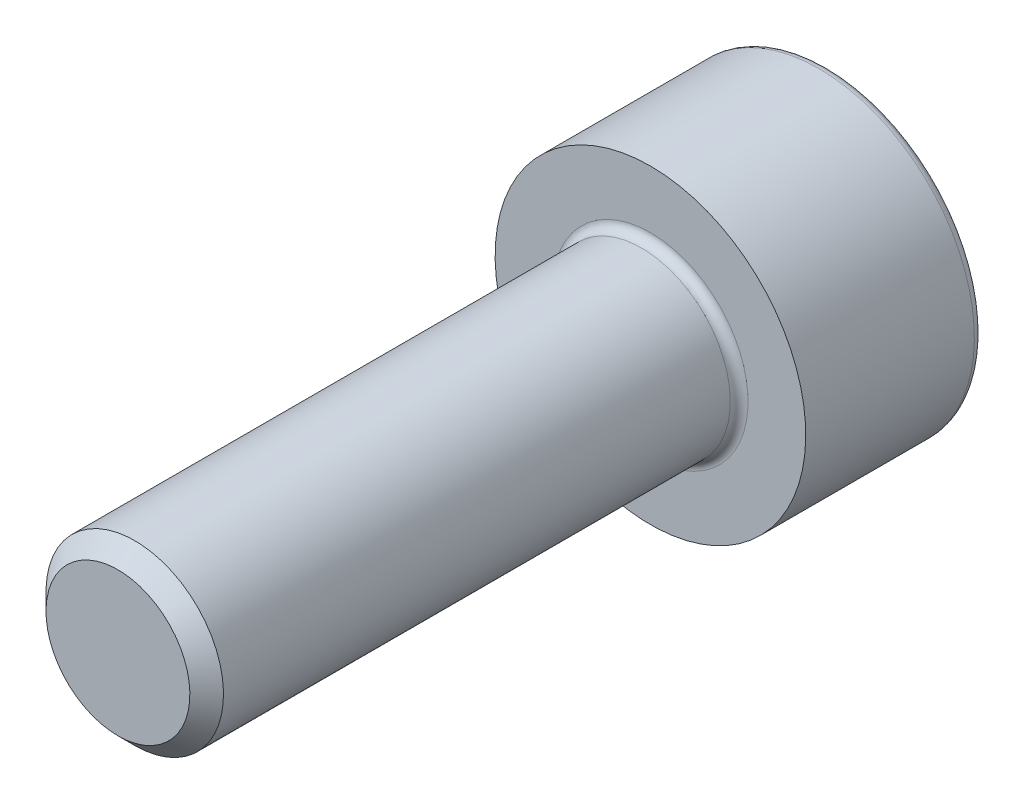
from build123d import *

# Parameters (mm, degrees)
CHAMFER1_SIZE      = 0.378875
FILLET1_R          = 0.2
HOLE1_D            = 3
HOLE1_DEPTH        = 2
HOLE1_TIP          = 0.866025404
CUT_EXTRUDE1_DEPTH = 2


with BuildPart() as part:
    # Sketch1 → Base-Revolve (revolve)
    with BuildSketch(Plane(origin=(0, 0, 0), x_dir=(0, 0, -1), z_dir=(1, 0, 0)), mode=Mode.PRIVATE) as base_revolve_sk:
        Polygon((4, 0), (4, 3.5), (0, 3.5), (0, 2), (-12, 2), (-12, 0), align=None)
    revolve(base_revolve_sk.sketch.rotate(Axis((0, 0, -4), (0, 0, 1)), 180), axis=Axis((0, 0, -4), (0, 0, 1)))

    # Chamfer1
    chamfer1_edges = [part.edges().sort_by_distance(p)[0] for p in [
        (0, 2, 12),
    ]]
    chamfer(chamfer1_edges, length=CHAMFER1_SIZE)

    # Fillet1
    fillet1_edges = [part.edges().sort_by_distance(p)[0] for p in [
        (0, 2, 0),
        (0, 3.5, -4),
    ]]
    fillet(fillet1_edges, radius=FILLET1_R)

    # Hole1
    with Locations(Plane(origin=(0, 0, -4), x_dir=(-1, 0, 0), z_dir=(0, 0, -1))):
        with Locations((0, 0)):
            Hole(HOLE1_D / 2, depth=HOLE1_DEPTH)
            with Locations((0, 0, -(HOLE1_DEPTH + HOLE1_TIP / 2))):  # 120° drill point
                Cone(0, HOLE1_D / 2, HOLE1_TIP, mode=Mode.SUBTRACT)

    # Sketch4 → Cut-Extrude1 (cut)
    with BuildSketch(Plane(origin=(0, 0, -4), x_dir=(-1, 0, 0), z_dir=(0, 0, -1))):
        Polygon((0.866025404, 1.5), (-0.866025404, 1.5), (-1.732050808, 0), (-0.866025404, -1.5), (0.866025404, -1.5), (1.732050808, 0), align=None)
    extrude(amount=-CUT_EXTRUDE1_DEPTH, mode=Mode.SUBTRACT)


solid = part.part
